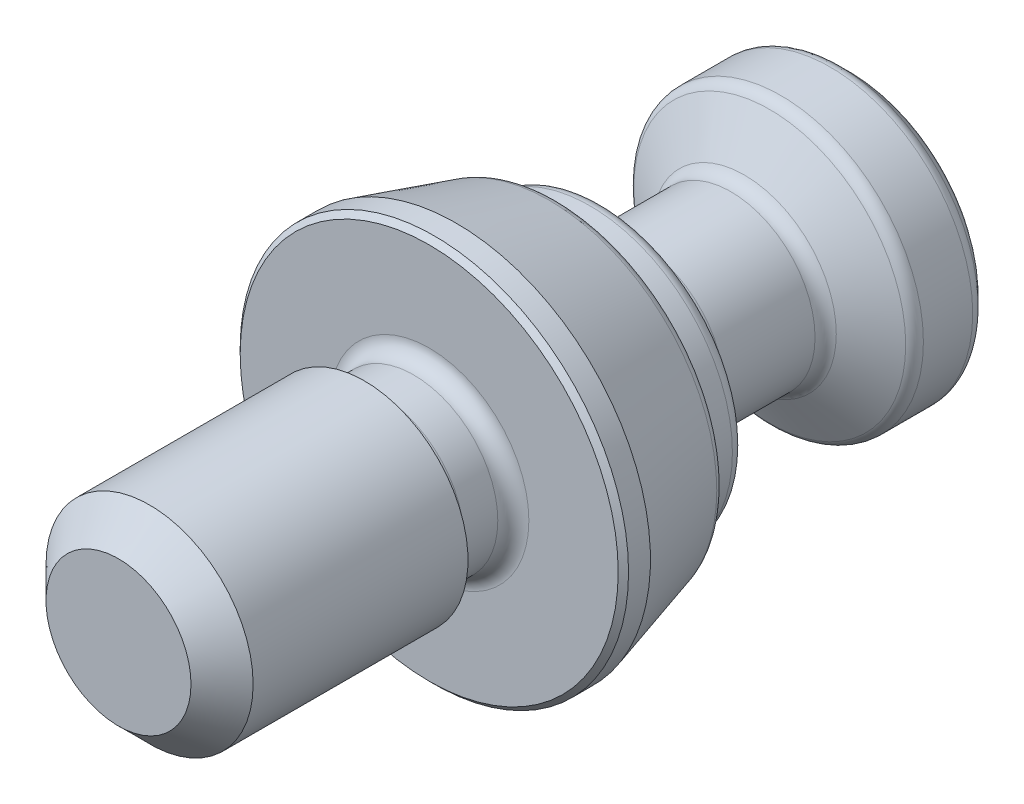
ISO-10303-21;
HEADER;
FILE_DESCRIPTION(('STEP AP214'),'2;1');
FILE_NAME('part.step','',(''),(''),'','','');
FILE_SCHEMA(('AUTOMOTIVE_DESIGN { 1 0 10303 214 1 1 1 1 }'));
ENDSEC;
DATA;
#1=APPLICATION_CONTEXT('core data for automotive mechanical design processes');
#2=APPLICATION_PROTOCOL_DEFINITION('international standard','automotive_design',2000,#1);
#3=PRODUCT_CONTEXT('',#1,'mechanical');
#4=PRODUCT('Part','Part','',(#3));
#5=PRODUCT_RELATED_PRODUCT_CATEGORY('part','',(#4));
#6=PRODUCT_DEFINITION_FORMATION('','',#4);
#7=PRODUCT_DEFINITION_CONTEXT('part definition',#1,'design');
#8=PRODUCT_DEFINITION('design','',#6,#7);
#9=PRODUCT_DEFINITION_SHAPE('','',#8);
#10=(LENGTH_UNIT() NAMED_UNIT(*) SI_UNIT(.MILLI.,.METRE.));
#11=(NAMED_UNIT(*) PLANE_ANGLE_UNIT() SI_UNIT($,.RADIAN.));
#12=(NAMED_UNIT(*) SI_UNIT($,.STERADIAN.) SOLID_ANGLE_UNIT());
#13=UNCERTAINTY_MEASURE_WITH_UNIT(LENGTH_MEASURE(1.E-05),#10,'distance_accuracy_value','');
#14=(GEOMETRIC_REPRESENTATION_CONTEXT(3) GLOBAL_UNCERTAINTY_ASSIGNED_CONTEXT((#13)) GLOBAL_UNIT_ASSIGNED_CONTEXT((#10,
#11,#12)) REPRESENTATION_CONTEXT('',''));
#15=CARTESIAN_POINT('',(0.,0.,0.));
#16=DIRECTION('',(0.,0.,1.));
#17=DIRECTION('',(1.,0.,0.));
#18=AXIS2_PLACEMENT_3D('',#15,#16,#17);
#19=CARTESIAN_POINT('',(0.,1.73205080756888,-14.));
#20=DIRECTION('',(0.,0.,-1.));
#21=DIRECTION('',(-1.,0.,0.));
#22=AXIS2_PLACEMENT_3D('',#19,#20,#21);
#23=PLANE('',#22);
#24=DIRECTION('',(0.,-1.,0.));
#25=VECTOR('',#24,1.);
#26=CARTESIAN_POINT('',(1.5,0.866025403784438,-14.));
#27=LINE('',#26,#25);
#28=CARTESIAN_POINT('',(1.5,0.866025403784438,-14.));
#29=VERTEX_POINT('',#28);
#30=CARTESIAN_POINT('',(1.5,0.,-14.));
#31=VERTEX_POINT('',#30);
#32=EDGE_CURVE('E222',#29,#31,#27,.T.);
#33=ORIENTED_EDGE('',*,*,#32,.T.);
#34=CARTESIAN_POINT('',(0.,0.,-14.));
#35=DIRECTION('',(0.,0.,1.));
#36=DIRECTION('',(1.,0.,0.));
#37=AXIS2_PLACEMENT_3D('',#34,#35,#36);
#38=CIRCLE('',#37,1.5);
#39=CARTESIAN_POINT('',(0.75,1.29903810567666,-14.));
#40=VERTEX_POINT('',#39);
#41=EDGE_CURVE('E29',#31,#40,#38,.T.);
#42=ORIENTED_EDGE('',*,*,#41,.T.);
#43=DIRECTION('',(0.866025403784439,-0.5,0.));
#44=VECTOR('',#43,1.);
#45=CARTESIAN_POINT('',(0.,1.73205080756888,-14.));
#46=LINE('',#45,#44);
#47=EDGE_CURVE('E685',#40,#29,#46,.T.);
#48=ORIENTED_EDGE('',*,*,#47,.T.);
#49=EDGE_LOOP('',(#33,#42,#48));
#50=FACE_BOUND('',#49,.T.);
#51=ADVANCED_FACE('F14',(#50),#23,.T.);
#52=CARTESIAN_POINT('',(0.,1.73205080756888,-14.));
#53=VERTEX_POINT('',#52);
#54=EDGE_CURVE('E686',#53,#40,#46,.T.);
#55=ORIENTED_EDGE('',*,*,#54,.T.);
#56=CARTESIAN_POINT('',(-0.75,1.29903810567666,-14.));
#57=VERTEX_POINT('',#56);
#58=EDGE_CURVE('E100',#40,#57,#38,.T.);
#59=ORIENTED_EDGE('',*,*,#58,.T.);
#60=DIRECTION('',(0.866025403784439,0.5,0.));
#61=VECTOR('',#60,1.);
#62=CARTESIAN_POINT('',(-1.5,0.86602540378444,-14.));
#63=LINE('',#62,#61);
#64=EDGE_CURVE('E681',#57,#53,#63,.T.);
#65=ORIENTED_EDGE('',*,*,#64,.T.);
#66=EDGE_LOOP('',(#55,#59,#65));
#67=FACE_BOUND('',#66,.T.);
#68=ADVANCED_FACE('F182',(#67),#23,.T.);
#69=CARTESIAN_POINT('',(-1.5,0.86602540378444,-14.));
#70=VERTEX_POINT('',#69);
#71=EDGE_CURVE('E682',#70,#57,#63,.T.);
#72=ORIENTED_EDGE('',*,*,#71,.T.);
#73=CARTESIAN_POINT('',(-1.5,0.,-14.));
#74=VERTEX_POINT('',#73);
#75=EDGE_CURVE('E704',#57,#74,#38,.T.);
#76=ORIENTED_EDGE('',*,*,#75,.T.);
#77=DIRECTION('',(0.,1.,0.));
#78=VECTOR('',#77,1.);
#79=CARTESIAN_POINT('',(-1.5,-0.866025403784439,-14.));
#80=LINE('',#79,#78);
#81=EDGE_CURVE('E227',#74,#70,#80,.T.);
#82=ORIENTED_EDGE('',*,*,#81,.T.);
#83=EDGE_LOOP('',(#72,#76,#82));
#84=FACE_BOUND('',#83,.T.);
#85=ADVANCED_FACE('F190',(#84),#23,.T.);
#86=CARTESIAN_POINT('',(-1.5,-0.866025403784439,-14.));
#87=VERTEX_POINT('',#86);
#88=EDGE_CURVE('E228',#87,#74,#80,.T.);
#89=ORIENTED_EDGE('',*,*,#88,.T.);
#90=CARTESIAN_POINT('',(-0.75,-1.29903810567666,-14.));
#91=VERTEX_POINT('',#90);
#92=EDGE_CURVE('E703',#74,#91,#38,.T.);
#93=ORIENTED_EDGE('',*,*,#92,.T.);
#94=DIRECTION('',(-0.866025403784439,0.5,0.));
#95=VECTOR('',#94,1.);
#96=CARTESIAN_POINT('',(0.,-1.73205080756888,-14.));
#97=LINE('',#96,#95);
#98=EDGE_CURVE('E217',#91,#87,#97,.T.);
#99=ORIENTED_EDGE('',*,*,#98,.T.);
#100=EDGE_LOOP('',(#89,#93,#99));
#101=FACE_BOUND('',#100,.T.);
#102=ADVANCED_FACE('F206',(#101),#23,.T.);
#103=CARTESIAN_POINT('',(0.,-1.73205080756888,-14.));
#104=VERTEX_POINT('',#103);
#105=EDGE_CURVE('E220',#104,#91,#97,.T.);
#106=ORIENTED_EDGE('',*,*,#105,.T.);
#107=CARTESIAN_POINT('',(0.75,-1.29903810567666,-14.));
#108=VERTEX_POINT('',#107);
#109=EDGE_CURVE('E701',#91,#108,#38,.T.);
#110=ORIENTED_EDGE('',*,*,#109,.T.);
#111=DIRECTION('',(-0.866025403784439,-0.5,0.));
#112=VECTOR('',#111,1.);
#113=CARTESIAN_POINT('',(1.5,-0.866025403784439,-14.));
#114=LINE('',#113,#112);
#115=EDGE_CURVE('E218',#108,#104,#114,.T.);
#116=ORIENTED_EDGE('',*,*,#115,.T.);
#117=EDGE_LOOP('',(#106,#110,#116));
#118=FACE_BOUND('',#117,.T.);
#119=ADVANCED_FACE('F196',(#118),#23,.T.);
#120=CARTESIAN_POINT('',(1.5,-0.866025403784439,-14.));
#121=VERTEX_POINT('',#120);
#122=EDGE_CURVE('E210',#121,#108,#114,.T.);
#123=ORIENTED_EDGE('',*,*,#122,.T.);
#124=EDGE_CURVE('E101',#108,#31,#38,.T.);
#125=ORIENTED_EDGE('',*,*,#124,.T.);
#126=EDGE_CURVE('E212',#31,#121,#27,.T.);
#127=ORIENTED_EDGE('',*,*,#126,.T.);
#128=EDGE_LOOP('',(#123,#125,#127));
#129=FACE_BOUND('',#128,.T.);
#130=ADVANCED_FACE('F185',(#129),#23,.T.);
#131=CARTESIAN_POINT('',(0.,5.5005,-16.5));
#132=DIRECTION('',(0.,0.,-1.));
#133=DIRECTION('',(-1.,0.,0.));
#134=AXIS2_PLACEMENT_3D('',#131,#132,#133);
#135=PLANE('',#134);
#136=CARTESIAN_POINT('',(0.,0.,-16.5));
#137=DIRECTION('',(0.,0.,-1.));
#138=DIRECTION('',(-1.,0.,0.));
#139=AXIS2_PLACEMENT_3D('',#136,#137,#138);
#140=CIRCLE('',#139,4.28578643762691);
#141=CARTESIAN_POINT('',(-4.28578643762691,0.,-16.5));
#142=VERTEX_POINT('',#141);
#143=EDGE_CURVE('E269',#142,#142,#140,.T.);
#144=ORIENTED_EDGE('',*,*,#143,.T.);
#145=EDGE_LOOP('',(#144));
#146=FACE_BOUND('',#145,.T.);
#147=CARTESIAN_POINT('',(0.,0.,-16.5));
#148=DIRECTION('',(0.,0.,1.));
#149=DIRECTION('',(1.,0.,0.));
#150=AXIS2_PLACEMENT_3D('',#147,#148,#149);
#151=CIRCLE('',#150,2.);
#152=CARTESIAN_POINT('',(2.,0.,-16.5));
#153=VERTEX_POINT('',#152);
#154=EDGE_CURVE('E98',#153,#153,#151,.T.);
#155=ORIENTED_EDGE('',*,*,#154,.T.);
#156=EDGE_LOOP('',(#155));
#157=FACE_BOUND('',#156,.T.);
#158=ADVANCED_FACE('F195',(#146,#157),#135,.T.);
#159=CARTESIAN_POINT('',(0.,0.,0.));
#160=DIRECTION('',(0.,0.,1.));
#161=DIRECTION('',(1.,0.,0.));
#162=AXIS2_PLACEMENT_3D('',#159,#160,#161);
#163=CYLINDRICAL_SURFACE('',#162,5.5);
#164=CARTESIAN_POINT('',(0.,0.,-15.4928932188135));
#165=DIRECTION('',(0.,0.,-1.));
#166=DIRECTION('',(-1.,0.,0.));
#167=AXIS2_PLACEMENT_3D('',#164,#165,#166);
#168=CIRCLE('',#167,5.5);
#169=CARTESIAN_POINT('',(-5.5,0.,-15.4928932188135));
#170=VERTEX_POINT('',#169);
#171=EDGE_CURVE('E293',#170,#170,#168,.F.);
#172=ORIENTED_EDGE('',*,*,#171,.T.);
#173=EDGE_LOOP('',(#172));
#174=FACE_BOUND('',#173,.T.);
#175=CARTESIAN_POINT('',(0.,0.,-13.5877132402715));
#176=DIRECTION('',(0.,0.,-1.));
#177=DIRECTION('',(-1.,0.,0.));
#178=AXIS2_PLACEMENT_3D('',#175,#176,#177);
#179=CIRCLE('',#178,5.5);
#180=CARTESIAN_POINT('',(-5.5,0.,-13.5877132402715));
#181=VERTEX_POINT('',#180);
#182=EDGE_CURVE('E290',#181,#181,#179,.T.);
#183=ORIENTED_EDGE('',*,*,#182,.T.);
#184=EDGE_LOOP('',(#183));
#185=FACE_BOUND('',#184,.T.);
#186=ADVANCED_FACE('F203',(#174,#185),#163,.T.);
#187=CARTESIAN_POINT('',(0.,0.,0.));
#188=DIRECTION('',(0.,0.,-1.));
#189=DIRECTION('',(-1.,0.,0.));
#190=AXIS2_PLACEMENT_3D('',#187,#188,#189);
#191=CYLINDRICAL_SURFACE('',#190,5.5005);
#192=CARTESIAN_POINT('',(0.,0.,-5.4));
#193=DIRECTION('',(0.,0.,-1.));
#194=DIRECTION('',(-1.,0.,0.));
#195=AXIS2_PLACEMENT_3D('',#192,#193,#194);
#196=CIRCLE('',#195,5.5005);
#197=CARTESIAN_POINT('',(-5.5005,0.,-5.4));
#198=VERTEX_POINT('',#197);
#199=EDGE_CURVE('E9',#198,#198,#196,.T.);
#200=ORIENTED_EDGE('',*,*,#199,.T.);
#201=EDGE_LOOP('',(#200));
#202=FACE_BOUND('',#201,.T.);
#203=CARTESIAN_POINT('',(0.,0.,-6.21132486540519));
#204=DIRECTION('',(0.,0.,-1.));
#205=DIRECTION('',(-1.,0.,0.));
#206=AXIS2_PLACEMENT_3D('',#203,#204,#205);
#207=CIRCLE('',#206,5.5005);
#208=CARTESIAN_POINT('',(-5.5005,0.,-6.21132486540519));
#209=VERTEX_POINT('',#208);
#210=EDGE_CURVE('E302',#209,#209,#207,.F.);
#211=ORIENTED_EDGE('',*,*,#210,.T.);
#212=EDGE_LOOP('',(#211));
#213=FACE_BOUND('',#212,.T.);
#214=ADVANCED_FACE('F330',(#202,#213),#191,.T.);
#215=CARTESIAN_POINT('',(0.,0.,-6.5));
#216=DIRECTION('',(0.,0.,1.));
#217=DIRECTION('',(1.,0.,0.));
#218=AXIS2_PLACEMENT_3D('',#215,#216,#217);
#219=CONICAL_SURFACE('',#218,5.5005,1.0471975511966);
#220=CARTESIAN_POINT('',(0.,0.,-6.64433756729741));
#221=DIRECTION('',(0.,0.,-1.));
#222=DIRECTION('',(-1.,0.,0.));
#223=AXIS2_PLACEMENT_3D('',#220,#221,#222);
#224=CIRCLE('',#223,5.2505);
#225=CARTESIAN_POINT('',(-5.2505,0.,-6.64433756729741));
#226=VERTEX_POINT('',#225);
#227=EDGE_CURVE('E305',#226,#226,#224,.T.);
#228=ORIENTED_EDGE('',*,*,#227,.T.);
#229=EDGE_LOOP('',(#228));
#230=FACE_BOUND('',#229,.T.);
#231=CARTESIAN_POINT('',(0.,0.,-7.62612170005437));
#232=DIRECTION('',(0.,0.,1.));
#233=DIRECTION('',(1.,0.,0.));
#234=AXIS2_PLACEMENT_3D('',#231,#232,#233);
#235=CIRCLE('',#234,3.55);
#236=CARTESIAN_POINT('',(3.55,0.,-7.62612170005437));
#237=VERTEX_POINT('',#236);
#238=EDGE_CURVE('E257',#237,#237,#235,.T.);
#239=ORIENTED_EDGE('',*,*,#238,.T.);
#240=EDGE_LOOP('',(#239));
#241=FACE_BOUND('',#240,.T.);
#242=ADVANCED_FACE('F333',(#230,#241),#219,.T.);
#243=CARTESIAN_POINT('',(0.,0.,0.));
#244=DIRECTION('',(0.,0.,1.));
#245=DIRECTION('',(1.,0.,0.));
#246=AXIS2_PLACEMENT_3D('',#243,#244,#245);
#247=CYLINDRICAL_SURFACE('',#246,3.25);
#248=CARTESIAN_POINT('',(0.,0.,-11.6535898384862));
#249=DIRECTION('',(0.,0.,1.));
#250=DIRECTION('',(1.,0.,0.));
#251=AXIS2_PLACEMENT_3D('',#248,#249,#250);
#252=CIRCLE('',#251,3.25);
#253=CARTESIAN_POINT('',(3.25,0.,-11.6535898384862));
#254=VERTEX_POINT('',#253);
#255=EDGE_CURVE('E251',#254,#254,#252,.T.);
#256=ORIENTED_EDGE('',*,*,#255,.T.);
#257=EDGE_LOOP('',(#256));
#258=FACE_BOUND('',#257,.T.);
#259=CARTESIAN_POINT('',(0.,0.,-8.14573694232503));
#260=DIRECTION('',(0.,0.,1.));
#261=DIRECTION('',(1.,0.,0.));
#262=AXIS2_PLACEMENT_3D('',#259,#260,#261);
#263=CIRCLE('',#262,3.25);
#264=CARTESIAN_POINT('',(3.25,0.,-8.14573694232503));
#265=VERTEX_POINT('',#264);
#266=EDGE_CURVE('E235',#265,#265,#263,.F.);
#267=ORIENTED_EDGE('',*,*,#266,.T.);
#268=EDGE_LOOP('',(#267));
#269=FACE_BOUND('',#268,.T.);
#270=ADVANCED_FACE('F397',(#258,#269),#247,.T.);
#271=CARTESIAN_POINT('',(0.,0.,-12.));
#272=DIRECTION('',(0.,0.,-1.));
#273=DIRECTION('',(-1.,0.,0.));
#274=AXIS2_PLACEMENT_3D('',#271,#272,#273);
#275=CONICAL_SURFACE('',#274,3.25,1.0471975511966);
#276=CARTESIAN_POINT('',(0.,0.,-13.1547005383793));
#277=DIRECTION('',(0.,0.,1.));
#278=DIRECTION('',(1.,0.,0.));
#279=AXIS2_PLACEMENT_3D('',#276,#277,#278);
#280=CIRCLE('',#279,5.25);
#281=CARTESIAN_POINT('',(5.25,0.,-13.1547005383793));
#282=VERTEX_POINT('',#281);
#283=EDGE_CURVE('E299',#282,#282,#280,.T.);
#284=ORIENTED_EDGE('',*,*,#283,.T.);
#285=EDGE_LOOP('',(#284));
#286=FACE_BOUND('',#285,.T.);
#287=CARTESIAN_POINT('',(0.,0.,-12.1732050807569));
#288=DIRECTION('',(0.,0.,-1.));
#289=DIRECTION('',(-1.,0.,0.));
#290=AXIS2_PLACEMENT_3D('',#287,#288,#289);
#291=CIRCLE('',#290,3.55);
#292=CARTESIAN_POINT('',(-3.55,0.,-12.1732050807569));
#293=VERTEX_POINT('',#292);
#294=EDGE_CURVE('E254',#293,#293,#291,.T.);
#295=ORIENTED_EDGE('',*,*,#294,.T.);
#296=EDGE_LOOP('',(#295));
#297=FACE_BOUND('',#296,.T.);
#298=ADVANCED_FACE('F401',(#286,#297),#275,.T.);
#299=CARTESIAN_POINT('',(0.,0.,-15.7));
#300=DIRECTION('',(0.,0.,1.));
#301=DIRECTION('',(1.,0.,0.));
#302=AXIS2_PLACEMENT_3D('',#299,#300,#301);
#303=CONICAL_SURFACE('',#302,5.5,0.785398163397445);
#304=CARTESIAN_POINT('',(0.,0.,-15.8464466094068));
#305=DIRECTION('',(0.,0.,-1.));
#306=DIRECTION('',(-1.,0.,0.));
#307=AXIS2_PLACEMENT_3D('',#304,#305,#306);
#308=CIRCLE('',#307,5.35355339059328);
#309=CARTESIAN_POINT('',(-5.35355339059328,0.,-15.8464466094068));
#310=VERTEX_POINT('',#309);
#311=EDGE_CURVE('E296',#310,#310,#308,.T.);
#312=ORIENTED_EDGE('',*,*,#311,.T.);
#313=EDGE_LOOP('',(#312));
#314=FACE_BOUND('',#313,.T.);
#315=CARTESIAN_POINT('',(0.,0.,-16.2071067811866));
#316=DIRECTION('',(0.,0.,-1.));
#317=DIRECTION('',(-1.,0.,0.));
#318=AXIS2_PLACEMENT_3D('',#315,#316,#317);
#319=CIRCLE('',#318,4.99289321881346);
#320=CARTESIAN_POINT('',(-4.99289321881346,0.,-16.2071067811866));
#321=VERTEX_POINT('',#320);
#322=EDGE_CURVE('E266',#321,#321,#319,.F.);
#323=ORIENTED_EDGE('',*,*,#322,.T.);
#324=EDGE_LOOP('',(#323));
#325=FACE_BOUND('',#324,.T.);
#326=ADVANCED_FACE('F383',(#314,#325),#303,.T.);
#327=CARTESIAN_POINT('',(0.,0.,-11.6535898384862));
#328=DIRECTION('',(0.,0.,1.));
#329=DIRECTION('',(1.,0.,0.));
#330=AXIS2_PLACEMENT_3D('',#327,#328,#329);
#331=TOROIDAL_SURFACE('',#330,3.85,0.6);
#332=ORIENTED_EDGE('',*,*,#294,.F.);
#333=EDGE_LOOP('',(#332));
#334=FACE_BOUND('',#333,.T.);
#335=ORIENTED_EDGE('',*,*,#255,.F.);
#336=EDGE_LOOP('',(#335));
#337=FACE_BOUND('',#336,.T.);
#338=ADVANCED_FACE('F379',(#334,#337),#331,.F.);
#339=CARTESIAN_POINT('',(0.,0.,-8.14573694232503));
#340=DIRECTION('',(0.,0.,1.));
#341=DIRECTION('',(1.,0.,0.));
#342=AXIS2_PLACEMENT_3D('',#339,#340,#341);
#343=TOROIDAL_SURFACE('',#342,3.85,0.6);
#344=ORIENTED_EDGE('',*,*,#266,.F.);
#345=EDGE_LOOP('',(#344));
#346=FACE_BOUND('',#345,.T.);
#347=ORIENTED_EDGE('',*,*,#238,.F.);
#348=EDGE_LOOP('',(#347));
#349=FACE_BOUND('',#348,.T.);
#350=ADVANCED_FACE('F369',(#346,#349),#343,.F.);
#351=CARTESIAN_POINT('',(0.,0.,-15.5));
#352=DIRECTION('',(0.,0.,-1.));
#353=DIRECTION('',(-1.,0.,0.));
#354=AXIS2_PLACEMENT_3D('',#351,#352,#353);
#355=TOROIDAL_SURFACE('',#354,4.28578643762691,1.);
#356=ORIENTED_EDGE('',*,*,#143,.F.);
#357=EDGE_LOOP('',(#356));
#358=FACE_BOUND('',#357,.T.);
#359=ORIENTED_EDGE('',*,*,#322,.F.);
#360=EDGE_LOOP('',(#359));
#361=FACE_BOUND('',#360,.T.);
#362=ADVANCED_FACE('F131',(#358,#361),#355,.T.);
#363=CARTESIAN_POINT('',(0.,0.,-16.5));
#364=DIRECTION('',(0.,0.,-1.));
#365=DIRECTION('',(-1.,0.,0.));
#366=AXIS2_PLACEMENT_3D('',#363,#364,#365);
#367=CONICAL_SURFACE('',#366,2.,1.0471975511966);
#368=ORIENTED_EDGE('',*,*,#154,.F.);
#369=EDGE_LOOP('',(#368));
#370=FACE_BOUND('',#369,.T.);
#371=CARTESIAN_POINT('',(1.5002,0.8659099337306,-16.3453661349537));
#372=CARTESIAN_POINT('',(1.43428070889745,0.903968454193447,-16.3233823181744));
#373=CARTESIAN_POINT('',(1.36779241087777,0.942355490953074,-16.303388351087));
#374=CARTESIAN_POINT('',(1.23366433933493,1.01979436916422,-16.2684875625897));
#375=CARTESIAN_POINT('',(1.16602218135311,1.05884758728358,-16.2535930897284));
#376=CARTESIAN_POINT('',(1.03157622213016,1.13646999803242,-16.2304061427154));
#377=CARTESIAN_POINT('',(0.964793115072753,1.17502724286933,-16.221959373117));
#378=CARTESIAN_POINT('',(0.830912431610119,1.25232329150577,-16.211873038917));
#379=CARTESIAN_POINT('',(0.763815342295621,1.29106181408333,-16.2102251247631));
#380=CARTESIAN_POINT('',(0.638425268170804,1.363455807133,-16.2136410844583));
#381=CARTESIAN_POINT('',(0.580113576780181,1.39712207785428,-16.2178662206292));
#382=CARTESIAN_POINT('',(0.463870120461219,1.46423526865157,-16.2312612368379));
#383=CARTESIAN_POINT('',(0.405938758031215,1.49768195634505,-16.240435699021));
#384=CARTESIAN_POINT('',(0.289455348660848,1.56493368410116,-16.2633726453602));
#385=CARTESIAN_POINT('',(0.230918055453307,1.59873020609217,-16.2772324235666));
#386=CARTESIAN_POINT('',(0.114716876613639,1.6658189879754,-16.3086892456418));
#387=CARTESIAN_POINT('',(0.0570515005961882,1.699112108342,-16.3262788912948));
#388=CARTESIAN_POINT('',(-0.000200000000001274,1.73216627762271,-16.3453661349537));
#389=B_SPLINE_CURVE_WITH_KNOTS('',3,(#371,#372,#373,#374,#375,#376,#377,#378,#379,#380,#381,
#382,#383,#384,#385,#386,#387,#388),.UNSPECIFIED.,.F.,.F.,(4,2,2,2,2,2,2,2,4),(0.,
0.237777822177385,0.476127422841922,0.708577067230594,0.940741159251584,1.14294352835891,
1.34533342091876,1.55221450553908,1.75868901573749),.UNSPECIFIED.);
#390=CARTESIAN_POINT('',(1.5,0.866025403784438,-16.3452994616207));
#391=VERTEX_POINT('',#390);
#392=CARTESIAN_POINT('',(0.,1.73205080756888,-16.3452994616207));
#393=VERTEX_POINT('',#392);
#394=EDGE_CURVE('E37',#391,#393,#389,.T.);
#395=ORIENTED_EDGE('',*,*,#394,.T.);
#396=CARTESIAN_POINT('',(0.000199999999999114,1.73216627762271,-16.3453661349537));
#397=CARTESIAN_POINT('',(-0.0657192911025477,1.69410775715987,-16.3233823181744));
#398=CARTESIAN_POINT('',(-0.132207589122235,1.65572072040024,-16.303388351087));
#399=CARTESIAN_POINT('',(-0.266335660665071,1.5782818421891,-16.2684875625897));
#400=CARTESIAN_POINT('',(-0.333977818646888,1.53922862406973,-16.2535930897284));
#401=CARTESIAN_POINT('',(-0.468423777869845,1.4616062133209,-16.2304061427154));
#402=CARTESIAN_POINT('',(-0.53520688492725,1.42304896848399,-16.221959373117));
#403=CARTESIAN_POINT('',(-0.669087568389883,1.34575291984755,-16.211873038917));
#404=CARTESIAN_POINT('',(-0.736184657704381,1.30701439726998,-16.2102251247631));
#405=CARTESIAN_POINT('',(-0.861574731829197,1.23462040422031,-16.2136410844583));
#406=CARTESIAN_POINT('',(-0.91988642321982,1.20095413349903,-16.2178662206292));
#407=CARTESIAN_POINT('',(-1.03612987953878,1.13384094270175,-16.2312612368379));
#408=CARTESIAN_POINT('',(-1.09406124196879,1.10039425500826,-16.240435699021));
#409=CARTESIAN_POINT('',(-1.21054465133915,1.03314252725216,-16.2633726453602));
#410=CARTESIAN_POINT('',(-1.26908194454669,0.999346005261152,-16.2772324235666));
#411=CARTESIAN_POINT('',(-1.38528312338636,0.932257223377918,-16.3086892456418));
#412=CARTESIAN_POINT('',(-1.44294849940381,0.898964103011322,-16.3262788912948));
#413=CARTESIAN_POINT('',(-1.5002,0.865909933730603,-16.3453661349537));
#414=B_SPLINE_CURVE_WITH_KNOTS('',3,(#396,#397,#398,#399,#400,#401,#402,#403,#404,#405,#406,
#407,#408,#409,#410,#411,#412,#413),.UNSPECIFIED.,.F.,.F.,(4,2,2,2,2,2,2,2,4),(0.,
0.237777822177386,0.476127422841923,0.708577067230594,0.940741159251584,1.14294352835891,
1.34533342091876,1.55221450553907,1.75868901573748),.UNSPECIFIED.);
#415=CARTESIAN_POINT('',(-1.5,0.86602540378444,-16.3452994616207));
#416=VERTEX_POINT('',#415);
#417=EDGE_CURVE('E107',#393,#416,#414,.T.);
#418=ORIENTED_EDGE('',*,*,#417,.T.);
#419=CARTESIAN_POINT('',(-1.5,-2.28397410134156,-16.9229071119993));
#420=CARTESIAN_POINT('',(-1.5,-2.21878991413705,-16.8914593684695));
#421=CARTESIAN_POINT('',(-1.5,-2.1534515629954,-16.8603257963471));
#422=CARTESIAN_POINT('',(-1.5,-2.02238403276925,-16.7988644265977));
#423=CARTESIAN_POINT('',(-1.5,-1.95665478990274,-16.7685367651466));
#424=CARTESIAN_POINT('',(-1.5,-1.82436364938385,-16.7087029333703));
#425=CARTESIAN_POINT('',(-1.5,-1.75779913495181,-16.6792025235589));
#426=CARTESIAN_POINT('',(-1.5,-1.62412650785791,-16.6214679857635));
#427=CARTESIAN_POINT('',(-1.5,-1.55701842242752,-16.5932337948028));
#428=CARTESIAN_POINT('',(-1.5,-1.42017535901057,-16.537561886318));
#429=CARTESIAN_POINT('',(-1.5,-1.35042088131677,-16.5101714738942));
#430=CARTESIAN_POINT('',(-1.5,-1.21009481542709,-16.4575777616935));
#431=CARTESIAN_POINT('',(-1.5,-1.13952312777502,-16.4323747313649));
#432=CARTESIAN_POINT('',(-1.5,-0.926675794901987,-16.3610629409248));
#433=CARTESIAN_POINT('',(-1.5,-0.782896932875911,-16.3190937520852));
#434=CARTESIAN_POINT('',(-1.5,-0.564495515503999,-16.2698234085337));
#435=CARTESIAN_POINT('',(-1.5,-0.491421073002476,-16.2556984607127));
#436=CARTESIAN_POINT('',(-1.5,-0.344405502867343,-16.2329184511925));
#437=CARTESIAN_POINT('',(-1.5,-0.27046444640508,-16.2242629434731));
#438=CARTESIAN_POINT('',(-1.5,-0.123035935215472,-16.2132228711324));
#439=CARTESIAN_POINT('',(-1.5,-0.0495544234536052,-16.2107610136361));
#440=CARTESIAN_POINT('',(-1.5,0.0973486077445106,-16.212108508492));
#441=CARTESIAN_POINT('',(-1.5,0.170770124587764,-16.2159181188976));
#442=CARTESIAN_POINT('',(-1.5,0.349490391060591,-16.2324885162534));
#443=CARTESIAN_POINT('',(-1.5,0.454491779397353,-16.2484687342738));
#444=CARTESIAN_POINT('',(-1.5,0.662502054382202,-16.2903432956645));
#445=CARTESIAN_POINT('',(-1.5,0.765508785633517,-16.3162477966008));
#446=CARTESIAN_POINT('',(-1.5,0.971670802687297,-16.3758329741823));
#447=CARTESIAN_POINT('',(-1.5,1.07477868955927,-16.409673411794));
#448=CARTESIAN_POINT('',(-1.5,1.279089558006,-16.4824928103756));
#449=CARTESIAN_POINT('',(-1.5,1.38029312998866,-16.521470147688));
#450=CARTESIAN_POINT('',(-1.5,1.62283010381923,-16.6198322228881));
#451=CARTESIAN_POINT('',(-1.5,1.76343848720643,-16.6809869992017));
#452=CARTESIAN_POINT('',(-1.5,2.0427026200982,-16.8076296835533));
#453=CARTESIAN_POINT('',(-1.5,2.18135782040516,-16.8731187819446));
#454=CARTESIAN_POINT('',(-1.5,2.4574437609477,-17.0069670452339));
#455=CARTESIAN_POINT('',(-1.5,2.59487311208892,-17.0753290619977));
#456=CARTESIAN_POINT('',(-1.5,2.86877401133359,-17.2139473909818));
#457=CARTESIAN_POINT('',(-1.5,3.0052455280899,-17.2842037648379));
#458=CARTESIAN_POINT('',(-1.5,3.26576619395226,-17.4199372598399));
#459=CARTESIAN_POINT('',(-1.5,3.38987264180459,-17.4853046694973));
#460=CARTESIAN_POINT('',(-1.5,3.63764859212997,-17.6168720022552));
#461=CARTESIAN_POINT('',(-1.5,3.76131807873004,-17.6830719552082));
#462=CARTESIAN_POINT('',(-1.5,4.00801757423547,-17.8159423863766));
#463=CARTESIAN_POINT('',(-1.5,4.13104840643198,-17.8826113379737));
#464=CARTESIAN_POINT('',(-1.5,4.37683251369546,-18.0164434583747));
#465=CARTESIAN_POINT('',(-1.5,4.49958580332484,-18.0836066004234));
#466=CARTESIAN_POINT('',(-1.5,4.62223761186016,-18.1509533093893));
#467=B_SPLINE_CURVE_WITH_KNOTS('',3,(#419,#420,#421,#422,#423,#424,#425,#426,#427,#428,#429,
#430,#431,#432,#433,#434,#435,#436,#437,#438,#439,#440,#441,#442,#443,#444,#445,#446,#447,#448,
#449,#450,#451,#452,#453,#454,#455,#456,#457,#458,#459,#460,#461,#462,#463,#464,#465,#466),
.UNSPECIFIED.,.F.,.F.,(4,2,2,2,2,2,2,2,2,2,2,2,2,2,2,2,2,2,2,2,2,2,2,4),(0.,0.217123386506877,
0.434283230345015,0.65269809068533,0.871102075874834,1.09588117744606,1.3206879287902,
1.7690939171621,1.99221104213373,2.21530997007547,2.43561063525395,2.65592036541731,
2.9738941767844,3.29219430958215,3.61755574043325,3.94281457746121,4.40267752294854,
4.86266729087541,5.3231249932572,5.78359769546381,6.20439980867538,6.62521705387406,
7.04501578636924,7.46479195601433),.UNSPECIFIED.);
#468=CARTESIAN_POINT('',(-1.5,-0.866025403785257,-16.3452994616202));
#469=VERTEX_POINT('',#468);
#470=EDGE_CURVE('E115',#416,#469,#467,.F.);
#471=ORIENTED_EDGE('',*,*,#470,.T.);
#472=CARTESIAN_POINT('',(-1.5002,-0.865909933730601,-16.3453661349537));
#473=CARTESIAN_POINT('',(-1.43428070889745,-0.903968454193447,-16.3233823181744));
#474=CARTESIAN_POINT('',(-1.36779241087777,-0.942355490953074,-16.303388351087));
#475=CARTESIAN_POINT('',(-1.23366433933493,-1.01979436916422,-16.2684875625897));
#476=CARTESIAN_POINT('',(-1.16602218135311,-1.05884758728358,-16.2535930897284));
#477=CARTESIAN_POINT('',(-1.03157622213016,-1.13646999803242,-16.2304061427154));
#478=CARTESIAN_POINT('',(-0.964793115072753,-1.17502724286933,-16.221959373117));
#479=CARTESIAN_POINT('',(-0.83091243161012,-1.25232329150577,-16.211873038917));
#480=CARTESIAN_POINT('',(-0.763815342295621,-1.29106181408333,-16.2102251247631));
#481=CARTESIAN_POINT('',(-0.638425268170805,-1.363455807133,-16.2136410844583));
#482=CARTESIAN_POINT('',(-0.580113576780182,-1.39712207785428,-16.2178662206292));
#483=CARTESIAN_POINT('',(-0.46387012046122,-1.46423526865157,-16.2312612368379));
#484=CARTESIAN_POINT('',(-0.405938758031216,-1.49768195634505,-16.240435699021));
#485=CARTESIAN_POINT('',(-0.289455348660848,-1.56493368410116,-16.2633726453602));
#486=CARTESIAN_POINT('',(-0.230918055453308,-1.59873020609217,-16.2772324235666));
#487=CARTESIAN_POINT('',(-0.114716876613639,-1.6658189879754,-16.3086892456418));
#488=CARTESIAN_POINT('',(-0.0570515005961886,-1.699112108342,-16.3262788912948));
#489=CARTESIAN_POINT('',(0.000200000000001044,-1.73216627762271,-16.3453661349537));
#490=B_SPLINE_CURVE_WITH_KNOTS('',3,(#472,#473,#474,#475,#476,#477,#478,#479,#480,#481,#482,
#483,#484,#485,#486,#487,#488,#489),.UNSPECIFIED.,.F.,.F.,(4,2,2,2,2,2,2,2,4),(0.,
0.237777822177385,0.476127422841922,0.708577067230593,0.940741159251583,1.14294352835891,
1.34533342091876,1.55221450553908,1.75868901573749),.UNSPECIFIED.);
#491=CARTESIAN_POINT('',(0.,-1.73205080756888,-16.3452994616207));
#492=VERTEX_POINT('',#491);
#493=EDGE_CURVE('E141',#469,#492,#490,.T.);
#494=ORIENTED_EDGE('',*,*,#493,.T.);
#495=CARTESIAN_POINT('',(-0.000199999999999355,-1.73216627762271,-16.3453661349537));
#496=CARTESIAN_POINT('',(0.0657192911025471,-1.69410775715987,-16.3233823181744));
#497=CARTESIAN_POINT('',(0.132207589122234,-1.65572072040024,-16.303388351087));
#498=CARTESIAN_POINT('',(0.26633566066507,-1.5782818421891,-16.2684875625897));
#499=CARTESIAN_POINT('',(0.333977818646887,-1.53922862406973,-16.2535930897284));
#500=CARTESIAN_POINT('',(0.468423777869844,-1.4616062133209,-16.2304061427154));
#501=CARTESIAN_POINT('',(0.535206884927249,-1.42304896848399,-16.221959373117));
#502=CARTESIAN_POINT('',(0.669087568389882,-1.34575291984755,-16.211873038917));
#503=CARTESIAN_POINT('',(0.73618465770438,-1.30701439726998,-16.2102251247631));
#504=CARTESIAN_POINT('',(0.861574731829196,-1.23462040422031,-16.2136410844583));
#505=CARTESIAN_POINT('',(0.91988642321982,-1.20095413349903,-16.2178662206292));
#506=CARTESIAN_POINT('',(1.03612987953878,-1.13384094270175,-16.2312612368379));
#507=CARTESIAN_POINT('',(1.09406124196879,-1.10039425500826,-16.240435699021));
#508=CARTESIAN_POINT('',(1.21054465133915,-1.03314252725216,-16.2633726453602));
#509=CARTESIAN_POINT('',(1.26908194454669,-0.999346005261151,-16.2772324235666));
#510=CARTESIAN_POINT('',(1.38528312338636,-0.932257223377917,-16.3086892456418));
#511=CARTESIAN_POINT('',(1.44294849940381,-0.89896410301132,-16.3262788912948));
#512=CARTESIAN_POINT('',(1.5002,-0.865909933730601,-16.3453661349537));
#513=B_SPLINE_CURVE_WITH_KNOTS('',3,(#495,#496,#497,#498,#499,#500,#501,#502,#503,#504,#505,
#506,#507,#508,#509,#510,#511,#512),.UNSPECIFIED.,.F.,.F.,(4,2,2,2,2,2,2,2,4),(0.,
0.237777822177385,0.476127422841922,0.708577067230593,0.940741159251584,1.14294352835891,
1.34533342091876,1.55221450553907,1.75868901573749),.UNSPECIFIED.);
#514=CARTESIAN_POINT('',(1.5,-0.866025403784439,-16.3452994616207));
#515=VERTEX_POINT('',#514);
#516=EDGE_CURVE('E148',#492,#515,#513,.T.);
#517=ORIENTED_EDGE('',*,*,#516,.T.);
#518=CARTESIAN_POINT('',(1.5,-2.28397410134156,-16.9229071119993));
#519=CARTESIAN_POINT('',(1.5,-2.21878991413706,-16.8914593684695));
#520=CARTESIAN_POINT('',(1.5,-2.1534515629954,-16.8603257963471));
#521=CARTESIAN_POINT('',(1.5,-2.02238403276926,-16.7988644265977));
#522=CARTESIAN_POINT('',(1.5,-1.95665478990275,-16.7685367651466));
#523=CARTESIAN_POINT('',(1.5,-1.82436364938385,-16.7087029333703));
#524=CARTESIAN_POINT('',(1.5,-1.75779913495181,-16.6792025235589));
#525=CARTESIAN_POINT('',(1.5,-1.62412650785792,-16.6214679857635));
#526=CARTESIAN_POINT('',(1.5,-1.55701842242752,-16.5932337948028));
#527=CARTESIAN_POINT('',(1.5,-1.42017535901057,-16.537561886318));
#528=CARTESIAN_POINT('',(1.5,-1.35042088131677,-16.5101714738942));
#529=CARTESIAN_POINT('',(1.5,-1.21009481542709,-16.4575777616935));
#530=CARTESIAN_POINT('',(1.5,-1.13952312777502,-16.4323747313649));
#531=CARTESIAN_POINT('',(1.5,-0.926675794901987,-16.3610629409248));
#532=CARTESIAN_POINT('',(1.5,-0.782896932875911,-16.3190937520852));
#533=CARTESIAN_POINT('',(1.5,-0.564495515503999,-16.2698234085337));
#534=CARTESIAN_POINT('',(1.5,-0.491421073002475,-16.2556984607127));
#535=CARTESIAN_POINT('',(1.5,-0.344405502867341,-16.2329184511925));
#536=CARTESIAN_POINT('',(1.5,-0.270464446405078,-16.2242629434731));
#537=CARTESIAN_POINT('',(1.5,-0.123035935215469,-16.2132228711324));
#538=CARTESIAN_POINT('',(1.5,-0.0495544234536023,-16.2107610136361));
#539=CARTESIAN_POINT('',(1.5,0.097348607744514,-16.212108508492));
#540=CARTESIAN_POINT('',(1.5,0.170770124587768,-16.2159181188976));
#541=CARTESIAN_POINT('',(1.5,0.349490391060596,-16.2324885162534));
#542=CARTESIAN_POINT('',(1.5,0.454491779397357,-16.2484687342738));
#543=CARTESIAN_POINT('',(1.5,0.662502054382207,-16.2903432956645));
#544=CARTESIAN_POINT('',(1.5,0.765508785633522,-16.3162477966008));
#545=CARTESIAN_POINT('',(1.5,0.971670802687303,-16.3758329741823));
#546=CARTESIAN_POINT('',(1.5,1.07477868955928,-16.409673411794));
#547=CARTESIAN_POINT('',(1.5,1.27908955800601,-16.4824928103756));
#548=CARTESIAN_POINT('',(1.5,1.38029312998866,-16.521470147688));
#549=CARTESIAN_POINT('',(1.5,1.62283010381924,-16.6198322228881));
#550=CARTESIAN_POINT('',(1.5,1.76343848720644,-16.6809869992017));
#551=CARTESIAN_POINT('',(1.5,2.04270262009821,-16.8076296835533));
#552=CARTESIAN_POINT('',(1.5,2.18135782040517,-16.8731187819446));
#553=CARTESIAN_POINT('',(1.5,2.45744376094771,-17.0069670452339));
#554=CARTESIAN_POINT('',(1.5,2.59487311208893,-17.0753290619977));
#555=CARTESIAN_POINT('',(1.5,2.8687740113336,-17.2139473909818));
#556=CARTESIAN_POINT('',(1.5,3.00524552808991,-17.2842037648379));
#557=CARTESIAN_POINT('',(1.5,3.26576619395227,-17.4199372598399));
#558=CARTESIAN_POINT('',(1.5,3.3898726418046,-17.4853046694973));
#559=CARTESIAN_POINT('',(1.5,3.63764859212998,-17.6168720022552));
#560=CARTESIAN_POINT('',(1.5,3.76131807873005,-17.6830719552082));
#561=CARTESIAN_POINT('',(1.5,4.00801757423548,-17.8159423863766));
#562=CARTESIAN_POINT('',(1.5,4.13104840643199,-17.8826113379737));
#563=CARTESIAN_POINT('',(1.5,4.37683251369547,-18.0164434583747));
#564=CARTESIAN_POINT('',(1.5,4.49958580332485,-18.0836066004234));
#565=CARTESIAN_POINT('',(1.5,4.62223761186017,-18.1509533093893));
#566=B_SPLINE_CURVE_WITH_KNOTS('',3,(#518,#519,#520,#521,#522,#523,#524,#525,#526,#527,#528,
#529,#530,#531,#532,#533,#534,#535,#536,#537,#538,#539,#540,#541,#542,#543,#544,#545,#546,#547,
#548,#549,#550,#551,#552,#553,#554,#555,#556,#557,#558,#559,#560,#561,#562,#563,#564,#565),
.UNSPECIFIED.,.F.,.F.,(4,2,2,2,2,2,2,2,2,2,2,2,2,2,2,2,2,2,2,2,2,2,2,4),(0.,0.217123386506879,
0.434283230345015,0.652698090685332,0.871102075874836,1.09588117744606,1.3206879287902,
1.76909391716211,1.99221104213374,2.21530997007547,2.43561063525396,2.65592036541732,
2.9738941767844,3.29219430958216,3.61755574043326,3.94281457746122,4.40267752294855,
4.86266729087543,5.32312499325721,5.78359769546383,6.2043998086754,6.62521705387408,
7.04501578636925,7.46479195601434),.UNSPECIFIED.);
#567=EDGE_CURVE('E155',#515,#391,#566,.T.);
#568=ORIENTED_EDGE('',*,*,#567,.T.);
#569=EDGE_LOOP('',(#395,#418,#471,#494,#517,#568));
#570=FACE_BOUND('',#569,.T.);
#571=ADVANCED_FACE('F126',(#370,#570),#367,.F.);
#572=CARTESIAN_POINT('',(-1.5,0.86602540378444,-14.));
#573=DIRECTION('',(-0.5,0.866025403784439,0.));
#574=DIRECTION('',(-0.866025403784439,-0.5,0.));
#575=AXIS2_PLACEMENT_3D('',#572,#573,#574);
#576=PLANE('',#575);
#577=ORIENTED_EDGE('',*,*,#417,.F.);
#578=DIRECTION('',(0.,0.,-1.));
#579=VECTOR('',#578,1.);
#580=CARTESIAN_POINT('',(0.,1.73205080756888,-14.));
#581=LINE('',#580,#579);
#582=EDGE_CURVE('E231',#53,#393,#581,.T.);
#583=ORIENTED_EDGE('',*,*,#582,.F.);
#584=ORIENTED_EDGE('',*,*,#64,.F.);
#585=ORIENTED_EDGE('',*,*,#71,.F.);
#586=DIRECTION('',(0.,0.,-1.));
#587=VECTOR('',#586,1.);
#588=CARTESIAN_POINT('',(-1.5,0.86602540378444,-14.));
#589=LINE('',#588,#587);
#590=EDGE_CURVE('E232',#70,#416,#589,.T.);
#591=ORIENTED_EDGE('',*,*,#590,.T.);
#592=EDGE_LOOP('',(#577,#583,#584,#585,#591));
#593=FACE_BOUND('',#592,.T.);
#594=ADVANCED_FACE('F122',(#593),#576,.F.);
#595=CARTESIAN_POINT('',(-1.5,-0.866025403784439,-14.));
#596=DIRECTION('',(-1.,0.,0.));
#597=DIRECTION('',(0.,-1.,0.));
#598=AXIS2_PLACEMENT_3D('',#595,#596,#597);
#599=PLANE('',#598);
#600=ORIENTED_EDGE('',*,*,#470,.F.);
#601=ORIENTED_EDGE('',*,*,#590,.F.);
#602=ORIENTED_EDGE('',*,*,#81,.F.);
#603=ORIENTED_EDGE('',*,*,#88,.F.);
#604=DIRECTION('',(0.,0.,-1.));
#605=VECTOR('',#604,1.);
#606=CARTESIAN_POINT('',(-1.5,-0.866025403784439,-14.));
#607=LINE('',#606,#605);
#608=EDGE_CURVE('E236',#87,#469,#607,.T.);
#609=ORIENTED_EDGE('',*,*,#608,.T.);
#610=EDGE_LOOP('',(#600,#601,#602,#603,#609));
#611=FACE_BOUND('',#610,.T.);
#612=ADVANCED_FACE('F492',(#611),#599,.F.);
#613=CARTESIAN_POINT('',(0.,-1.73205080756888,-14.));
#614=DIRECTION('',(-0.5,-0.866025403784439,0.));
#615=DIRECTION('',(0.866025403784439,-0.5,0.));
#616=AXIS2_PLACEMENT_3D('',#613,#614,#615);
#617=PLANE('',#616);
#618=ORIENTED_EDGE('',*,*,#493,.F.);
#619=ORIENTED_EDGE('',*,*,#608,.F.);
#620=ORIENTED_EDGE('',*,*,#98,.F.);
#621=ORIENTED_EDGE('',*,*,#105,.F.);
#622=DIRECTION('',(0.,0.,-1.));
#623=VECTOR('',#622,1.);
#624=CARTESIAN_POINT('',(0.,-1.73205080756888,-14.));
#625=LINE('',#624,#623);
#626=EDGE_CURVE('E239',#104,#492,#625,.T.);
#627=ORIENTED_EDGE('',*,*,#626,.T.);
#628=EDGE_LOOP('',(#618,#619,#620,#621,#627));
#629=FACE_BOUND('',#628,.T.);
#630=ADVANCED_FACE('F500',(#629),#617,.F.);
#631=CARTESIAN_POINT('',(1.5,-0.866025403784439,-14.));
#632=DIRECTION('',(0.5,-0.866025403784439,0.));
#633=DIRECTION('',(0.866025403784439,0.5,0.));
#634=AXIS2_PLACEMENT_3D('',#631,#632,#633);
#635=PLANE('',#634);
#636=ORIENTED_EDGE('',*,*,#516,.F.);
#637=ORIENTED_EDGE('',*,*,#626,.F.);
#638=ORIENTED_EDGE('',*,*,#115,.F.);
#639=ORIENTED_EDGE('',*,*,#122,.F.);
#640=DIRECTION('',(0.,0.,-1.));
#641=VECTOR('',#640,1.);
#642=CARTESIAN_POINT('',(1.5,-0.866025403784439,-14.));
#643=LINE('',#642,#641);
#644=EDGE_CURVE('E242',#121,#515,#643,.T.);
#645=ORIENTED_EDGE('',*,*,#644,.T.);
#646=EDGE_LOOP('',(#636,#637,#638,#639,#645));
#647=FACE_BOUND('',#646,.T.);
#648=ADVANCED_FACE('F170',(#647),#635,.F.);
#649=CARTESIAN_POINT('',(1.5,0.866025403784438,-14.));
#650=DIRECTION('',(1.,0.,0.));
#651=DIRECTION('',(0.,1.,0.));
#652=AXIS2_PLACEMENT_3D('',#649,#650,#651);
#653=PLANE('',#652);
#654=ORIENTED_EDGE('',*,*,#567,.F.);
#655=ORIENTED_EDGE('',*,*,#644,.F.);
#656=ORIENTED_EDGE('',*,*,#126,.F.);
#657=ORIENTED_EDGE('',*,*,#32,.F.);
#658=DIRECTION('',(0.,0.,-1.));
#659=VECTOR('',#658,1.);
#660=CARTESIAN_POINT('',(1.5,0.866025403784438,-14.));
#661=LINE('',#660,#659);
#662=EDGE_CURVE('E244',#29,#391,#661,.T.);
#663=ORIENTED_EDGE('',*,*,#662,.T.);
#664=EDGE_LOOP('',(#654,#655,#656,#657,#663));
#665=FACE_BOUND('',#664,.T.);
#666=ADVANCED_FACE('F166',(#665),#653,.F.);
#667=CARTESIAN_POINT('',(0.,1.73205080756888,-14.));
#668=DIRECTION('',(0.5,0.866025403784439,0.));
#669=DIRECTION('',(-0.866025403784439,0.5,0.));
#670=AXIS2_PLACEMENT_3D('',#667,#668,#669);
#671=PLANE('',#670);
#672=ORIENTED_EDGE('',*,*,#394,.F.);
#673=ORIENTED_EDGE('',*,*,#662,.F.);
#674=ORIENTED_EDGE('',*,*,#47,.F.);
#675=ORIENTED_EDGE('',*,*,#54,.F.);
#676=ORIENTED_EDGE('',*,*,#582,.T.);
#677=EDGE_LOOP('',(#672,#673,#674,#675,#676));
#678=FACE_BOUND('',#677,.T.);
#679=ADVANCED_FACE('F169',(#678),#671,.F.);
#680=CARTESIAN_POINT('',(0.,0.,0.));
#681=DIRECTION('',(0.,0.,1.));
#682=DIRECTION('',(1.,0.,0.));
#683=AXIS2_PLACEMENT_3D('',#680,#681,#682);
#684=CYLINDRICAL_SURFACE('',#683,1.5);
#685=CARTESIAN_POINT('',(0.,0.,-12.5));
#686=DIRECTION('',(0.,0.,1.));
#687=DIRECTION('',(1.,0.,0.));
#688=AXIS2_PLACEMENT_3D('',#685,#686,#687);
#689=CIRCLE('',#688,1.5);
#690=CARTESIAN_POINT('',(1.5,0.,-12.5));
#691=VERTEX_POINT('',#690);
#692=EDGE_CURVE('E94',#691,#691,#689,.T.);
#693=ORIENTED_EDGE('',*,*,#692,.T.);
#694=EDGE_LOOP('',(#693));
#695=FACE_BOUND('',#694,.T.);
#696=ORIENTED_EDGE('',*,*,#41,.F.);
#697=ORIENTED_EDGE('',*,*,#124,.F.);
#698=ORIENTED_EDGE('',*,*,#109,.F.);
#699=ORIENTED_EDGE('',*,*,#92,.F.);
#700=ORIENTED_EDGE('',*,*,#75,.F.);
#701=ORIENTED_EDGE('',*,*,#58,.F.);
#702=EDGE_LOOP('',(#696,#697,#698,#699,#700,#701));
#703=FACE_BOUND('',#702,.T.);
#704=ADVANCED_FACE('F90',(#695,#703),#684,.F.);
#705=CARTESIAN_POINT('',(0.,0.,-12.5));
#706=DIRECTION('',(0.,0.,-1.));
#707=DIRECTION('',(-1.,0.,0.));
#708=AXIS2_PLACEMENT_3D('',#705,#706,#707);
#709=CONICAL_SURFACE('',#708,1.5,1.17809724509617);
#710=CARTESIAN_POINT('',(0.,0.,-11.8786796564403));
#711=VERTEX_POINT('',#710);
#712=VERTEX_LOOP('',#711);
#713=FACE_BOUND('',#712,.T.);
#714=ORIENTED_EDGE('',*,*,#692,.F.);
#715=EDGE_LOOP('',(#714));
#716=FACE_BOUND('',#715,.T.);
#717=ADVANCED_FACE('F86',(#713,#716),#709,.F.);
#718=CARTESIAN_POINT('',(0.,0.,0.));
#719=DIRECTION('',(0.,0.,-1.));
#720=DIRECTION('',(-1.,0.,0.));
#721=AXIS2_PLACEMENT_3D('',#718,#719,#720);
#722=CYLINDRICAL_SURFACE('',#721,7.5);
#723=CARTESIAN_POINT('',(0.,0.,-0.199999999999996));
#724=DIRECTION('',(0.,0.,1.));
#725=DIRECTION('',(1.,0.,0.));
#726=AXIS2_PLACEMENT_3D('',#723,#724,#725);
#727=CIRCLE('',#726,7.5);
#728=CARTESIAN_POINT('',(7.5,0.,-0.199999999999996));
#729=VERTEX_POINT('',#728);
#730=EDGE_CURVE('E284',#729,#729,#727,.F.);
#731=ORIENTED_EDGE('',*,*,#730,.T.);
#732=EDGE_LOOP('',(#731));
#733=FACE_BOUND('',#732,.T.);
#734=CARTESIAN_POINT('',(0.,0.,-1.04622433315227));
#735=DIRECTION('',(0.,0.,-1.));
#736=DIRECTION('',(-1.,0.,0.));
#737=AXIS2_PLACEMENT_3D('',#734,#735,#736);
#738=CIRCLE('',#737,7.5);
#739=CARTESIAN_POINT('',(-7.5,0.,-1.04622433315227));
#740=VERTEX_POINT('',#739);
#741=EDGE_CURVE('E96',#740,#740,#738,.T.);
#742=ORIENTED_EDGE('',*,*,#741,.F.);
#743=EDGE_LOOP('',(#742));
#744=FACE_BOUND('',#743,.T.);
#745=ADVANCED_FACE('F89',(#733,#744),#722,.T.);
#746=CARTESIAN_POINT('',(0.,5.5005,-5.));
#747=DIRECTION('',(0.,0.,-1.));
#748=DIRECTION('',(-1.,0.,0.));
#749=AXIS2_PLACEMENT_3D('',#746,#747,#748);
#750=PLANE('',#749);
#751=CARTESIAN_POINT('',(0.,0.,-5.));
#752=DIRECTION('',(0.,0.,-1.));
#753=DIRECTION('',(-1.,0.,0.));
#754=AXIS2_PLACEMENT_3D('',#751,#752,#753);
#755=CIRCLE('',#754,5.9005);
#756=CARTESIAN_POINT('',(-5.9005,0.,-5.));
#757=VERTEX_POINT('',#756);
#758=EDGE_CURVE('E22',#757,#757,#755,.F.);
#759=ORIENTED_EDGE('',*,*,#758,.T.);
#760=EDGE_LOOP('',(#759));
#761=FACE_BOUND('',#760,.T.);
#762=CARTESIAN_POINT('',(0.,0.,-5.));
#763=DIRECTION('',(0.,0.,-1.));
#764=DIRECTION('',(-1.,0.,0.));
#765=AXIS2_PLACEMENT_3D('',#762,#763,#764);
#766=CIRCLE('',#765,5.98949604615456);
#767=CARTESIAN_POINT('',(-5.98949604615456,0.,-5.));
#768=VERTEX_POINT('',#767);
#769=EDGE_CURVE('E308',#768,#768,#766,.T.);
#770=ORIENTED_EDGE('',*,*,#769,.T.);
#771=EDGE_LOOP('',(#770));
#772=FACE_BOUND('',#771,.T.);
#773=ADVANCED_FACE('F316',(#761,#772),#750,.T.);
#774=CARTESIAN_POINT('',(0.,0.,-5.));
#775=DIRECTION('',(0.,0.,1.));
#776=DIRECTION('',(1.,0.,0.));
#777=AXIS2_PLACEMENT_3D('',#774,#775,#776);
#778=CONICAL_SURFACE('',#777,6.36627307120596,0.279252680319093);
#779=CARTESIAN_POINT('',(0.,0.,-4.6378186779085));
#780=DIRECTION('',(0.,0.,-1.));
#781=DIRECTION('',(-1.,0.,0.));
#782=AXIS2_PLACEMENT_3D('',#779,#780,#781);
#783=CIRCLE('',#782,6.47012689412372);
#784=CARTESIAN_POINT('',(-6.47012689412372,0.,-4.6378186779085));
#785=VERTEX_POINT('',#784);
#786=EDGE_CURVE('E311',#785,#785,#783,.F.);
#787=ORIENTED_EDGE('',*,*,#786,.T.);
#788=EDGE_LOOP('',(#787));
#789=FACE_BOUND('',#788,.T.);
#790=ORIENTED_EDGE('',*,*,#741,.T.);
#791=EDGE_LOOP('',(#790));
#792=FACE_BOUND('',#791,.T.);
#793=ADVANCED_FACE('F393',(#789,#792),#778,.T.);
#794=CARTESIAN_POINT('',(0.,0.,12.));
#795=DIRECTION('',(0.,0.,1.));
#796=DIRECTION('',(1.,0.,0.));
#797=AXIS2_PLACEMENT_3D('',#794,#795,#796);
#798=PLANE('',#797);
#799=CARTESIAN_POINT('',(0.,0.,12.));
#800=DIRECTION('',(0.,0.,1.));
#801=DIRECTION('',(1.,0.,0.));
#802=AXIS2_PLACEMENT_3D('',#799,#800,#801);
#803=CIRCLE('',#802,2.8);
#804=CARTESIAN_POINT('',(2.8,0.,12.));
#805=VERTEX_POINT('',#804);
#806=EDGE_CURVE('E263',#805,#805,#803,.T.);
#807=ORIENTED_EDGE('',*,*,#806,.T.);
#808=EDGE_LOOP('',(#807));
#809=FACE_BOUND('',#808,.T.);
#810=ADVANCED_FACE('F375',(#809),#798,.T.);
#811=CARTESIAN_POINT('',(0.,0.,10.8));
#812=DIRECTION('',(0.,0.,-1.));
#813=DIRECTION('',(-1.,0.,0.));
#814=AXIS2_PLACEMENT_3D('',#811,#812,#813);
#815=CONICAL_SURFACE('',#814,4.,0.785398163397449);
#816=ORIENTED_EDGE('',*,*,#806,.F.);
#817=EDGE_LOOP('',(#816));
#818=FACE_BOUND('',#817,.T.);
#819=CARTESIAN_POINT('',(0.,0.,10.8));
#820=DIRECTION('',(0.,0.,1.));
#821=DIRECTION('',(1.,0.,0.));
#822=AXIS2_PLACEMENT_3D('',#819,#820,#821);
#823=CIRCLE('',#822,4.);
#824=CARTESIAN_POINT('',(4.,0.,10.8));
#825=VERTEX_POINT('',#824);
#826=EDGE_CURVE('E260',#825,#825,#823,.F.);
#827=ORIENTED_EDGE('',*,*,#826,.F.);
#828=EDGE_LOOP('',(#827));
#829=FACE_BOUND('',#828,.T.);
#830=ADVANCED_FACE('F371',(#818,#829),#815,.T.);
#831=CARTESIAN_POINT('',(0.,0.,0.));
#832=DIRECTION('',(0.,0.,-1.));
#833=DIRECTION('',(-1.,0.,0.));
#834=AXIS2_PLACEMENT_3D('',#831,#832,#833);
#835=CYLINDRICAL_SURFACE('',#834,4.);
#836=CARTESIAN_POINT('',(0.,0.,2.5));
#837=DIRECTION('',(0.,0.,-1.));
#838=DIRECTION('',(-1.,0.,0.));
#839=AXIS2_PLACEMENT_3D('',#836,#837,#838);
#840=CIRCLE('',#839,4.);
#841=CARTESIAN_POINT('',(-4.,0.,2.5));
#842=VERTEX_POINT('',#841);
#843=EDGE_CURVE('E680',#842,#842,#840,.T.);
#844=ORIENTED_EDGE('',*,*,#843,.F.);
#845=EDGE_LOOP('',(#844));
#846=FACE_BOUND('',#845,.T.);
#847=ORIENTED_EDGE('',*,*,#826,.T.);
#848=EDGE_LOOP('',(#847));
#849=FACE_BOUND('',#848,.T.);
#850=ADVANCED_FACE('F374',(#846,#849),#835,.T.);
#851=CARTESIAN_POINT('',(0.,4.,2.5));
#852=DIRECTION('',(0.,0.,1.));
#853=DIRECTION('',(1.,0.,0.));
#854=AXIS2_PLACEMENT_3D('',#851,#852,#853);
#855=PLANE('',#854);
#856=CARTESIAN_POINT('',(0.,0.,2.5));
#857=DIRECTION('',(0.,0.,1.));
#858=DIRECTION('',(1.,0.,0.));
#859=AXIS2_PLACEMENT_3D('',#856,#857,#858);
#860=CIRCLE('',#859,3.85);
#861=CARTESIAN_POINT('',(3.85,0.,2.5));
#862=VERTEX_POINT('',#861);
#863=EDGE_CURVE('E278',#862,#862,#860,.T.);
#864=ORIENTED_EDGE('',*,*,#863,.T.);
#865=EDGE_LOOP('',(#864));
#866=FACE_BOUND('',#865,.T.);
#867=ORIENTED_EDGE('',*,*,#843,.T.);
#868=EDGE_LOOP('',(#867));
#869=FACE_BOUND('',#868,.T.);
#870=ADVANCED_FACE('F365',(#866,#869),#855,.F.);
#871=CARTESIAN_POINT('',(0.,0.,1.9));
#872=DIRECTION('',(0.,0.,1.));
#873=DIRECTION('',(1.,0.,0.));
#874=AXIS2_PLACEMENT_3D('',#871,#872,#873);
#875=TOROIDAL_SURFACE('',#874,3.85,0.6);
#876=ORIENTED_EDGE('',*,*,#863,.F.);
#877=EDGE_LOOP('',(#876));
#878=FACE_BOUND('',#877,.T.);
#879=CARTESIAN_POINT('',(0.,0.,1.9));
#880=DIRECTION('',(0.,0.,1.));
#881=DIRECTION('',(1.,0.,0.));
#882=AXIS2_PLACEMENT_3D('',#879,#880,#881);
#883=CIRCLE('',#882,3.25);
#884=CARTESIAN_POINT('',(3.25,0.,1.9));
#885=VERTEX_POINT('',#884);
#886=EDGE_CURVE('E275',#885,#885,#883,.F.);
#887=ORIENTED_EDGE('',*,*,#886,.F.);
#888=EDGE_LOOP('',(#887));
#889=FACE_BOUND('',#888,.T.);
#890=ADVANCED_FACE('F362',(#878,#889),#875,.F.);
#891=CARTESIAN_POINT('',(0.,0.,0.));
#892=DIRECTION('',(0.,0.,-1.));
#893=DIRECTION('',(-1.,0.,0.));
#894=AXIS2_PLACEMENT_3D('',#891,#892,#893);
#895=CYLINDRICAL_SURFACE('',#894,3.25);
#896=ORIENTED_EDGE('',*,*,#886,.T.);
#897=EDGE_LOOP('',(#896));
#898=FACE_BOUND('',#897,.T.);
#899=CARTESIAN_POINT('',(0.,0.,0.6));
#900=DIRECTION('',(0.,0.,1.));
#901=DIRECTION('',(1.,0.,0.));
#902=AXIS2_PLACEMENT_3D('',#899,#900,#901);
#903=CIRCLE('',#902,3.25);
#904=CARTESIAN_POINT('',(3.25,0.,0.6));
#905=VERTEX_POINT('',#904);
#906=EDGE_CURVE('E272',#905,#905,#903,.T.);
#907=ORIENTED_EDGE('',*,*,#906,.T.);
#908=EDGE_LOOP('',(#907));
#909=FACE_BOUND('',#908,.T.);
#910=ADVANCED_FACE('F133',(#898,#909),#895,.T.);
#911=CARTESIAN_POINT('',(0.,0.,0.6));
#912=DIRECTION('',(0.,0.,1.));
#913=DIRECTION('',(1.,0.,0.));
#914=AXIS2_PLACEMENT_3D('',#911,#912,#913);
#915=TOROIDAL_SURFACE('',#914,3.85,0.6);
#916=ORIENTED_EDGE('',*,*,#906,.F.);
#917=EDGE_LOOP('',(#916));
#918=FACE_BOUND('',#917,.T.);
#919=CARTESIAN_POINT('',(0.,0.,0.));
#920=DIRECTION('',(0.,0.,1.));
#921=DIRECTION('',(1.,0.,0.));
#922=AXIS2_PLACEMENT_3D('',#919,#920,#921);
#923=CIRCLE('',#922,3.85);
#924=CARTESIAN_POINT('',(3.85,0.,0.));
#925=VERTEX_POINT('',#924);
#926=EDGE_CURVE('E281',#925,#925,#923,.F.);
#927=ORIENTED_EDGE('',*,*,#926,.F.);
#928=EDGE_LOOP('',(#927));
#929=FACE_BOUND('',#928,.T.);
#930=ADVANCED_FACE('F358',(#918,#929),#915,.F.);
#931=CARTESIAN_POINT('',(0.,4.,0.));
#932=DIRECTION('',(0.,0.,1.));
#933=DIRECTION('',(1.,0.,0.));
#934=AXIS2_PLACEMENT_3D('',#931,#932,#933);
#935=PLANE('',#934);
#936=CARTESIAN_POINT('',(0.,0.,0.));
#937=DIRECTION('',(0.,0.,1.));
#938=DIRECTION('',(1.,0.,0.));
#939=AXIS2_PLACEMENT_3D('',#936,#937,#938);
#940=CIRCLE('',#939,7.3);
#941=CARTESIAN_POINT('',(7.3,0.,0.));
#942=VERTEX_POINT('',#941);
#943=EDGE_CURVE('E287',#942,#942,#940,.T.);
#944=ORIENTED_EDGE('',*,*,#943,.T.);
#945=EDGE_LOOP('',(#944));
#946=FACE_BOUND('',#945,.T.);
#947=ORIENTED_EDGE('',*,*,#926,.T.);
#948=EDGE_LOOP('',(#947));
#949=FACE_BOUND('',#948,.T.);
#950=ADVANCED_FACE('F356',(#946,#949),#935,.T.);
#951=CARTESIAN_POINT('',(0.,0.,-0.199999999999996));
#952=DIRECTION('',(0.,0.,-1.));
#953=DIRECTION('',(-1.,0.,0.));
#954=AXIS2_PLACEMENT_3D('',#951,#952,#953);
#955=CONICAL_SURFACE('',#954,7.5,0.785398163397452);
#956=ORIENTED_EDGE('',*,*,#943,.F.);
#957=EDGE_LOOP('',(#956));
#958=FACE_BOUND('',#957,.T.);
#959=ORIENTED_EDGE('',*,*,#730,.F.);
#960=EDGE_LOOP('',(#959));
#961=FACE_BOUND('',#960,.T.);
#962=ADVANCED_FACE('F352',(#958,#961),#955,.T.);
#963=CARTESIAN_POINT('',(0.,0.,-15.4928932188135));
#964=DIRECTION('',(0.,0.,-1.));
#965=DIRECTION('',(-1.,0.,0.));
#966=AXIS2_PLACEMENT_3D('',#963,#964,#965);
#967=TOROIDAL_SURFACE('',#966,5.,0.5);
#968=ORIENTED_EDGE('',*,*,#311,.F.);
#969=EDGE_LOOP('',(#968));
#970=FACE_BOUND('',#969,.T.);
#971=ORIENTED_EDGE('',*,*,#171,.F.);
#972=EDGE_LOOP('',(#971));
#973=FACE_BOUND('',#972,.T.);
#974=ADVANCED_FACE('F345',(#970,#973),#967,.T.);
#975=CARTESIAN_POINT('',(0.,0.,-13.5877132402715));
#976=DIRECTION('',(0.,0.,-1.));
#977=DIRECTION('',(-1.,0.,0.));
#978=AXIS2_PLACEMENT_3D('',#975,#976,#977);
#979=TOROIDAL_SURFACE('',#978,5.,0.5);
#980=ORIENTED_EDGE('',*,*,#182,.F.);
#981=EDGE_LOOP('',(#980));
#982=FACE_BOUND('',#981,.T.);
#983=ORIENTED_EDGE('',*,*,#283,.F.);
#984=EDGE_LOOP('',(#983));
#985=FACE_BOUND('',#984,.T.);
#986=ADVANCED_FACE('F338',(#982,#985),#979,.T.);
#987=CARTESIAN_POINT('',(0.,0.,-6.21132486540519));
#988=DIRECTION('',(0.,0.,-1.));
#989=DIRECTION('',(-1.,0.,0.));
#990=AXIS2_PLACEMENT_3D('',#987,#988,#989);
#991=TOROIDAL_SURFACE('',#990,5.0005,0.5);
#992=ORIENTED_EDGE('',*,*,#227,.F.);
#993=EDGE_LOOP('',(#992));
#994=FACE_BOUND('',#993,.T.);
#995=ORIENTED_EDGE('',*,*,#210,.F.);
#996=EDGE_LOOP('',(#995));
#997=FACE_BOUND('',#996,.T.);
#998=ADVANCED_FACE('F326',(#994,#997),#991,.T.);
#999=CARTESIAN_POINT('',(0.,0.,-4.5));
#1000=DIRECTION('',(0.,0.,-1.));
#1001=DIRECTION('',(-1.,0.,0.));
#1002=AXIS2_PLACEMENT_3D('',#999,#1000,#1001);
#1003=TOROIDAL_SURFACE('',#1002,5.98949604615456,0.5);
#1004=ORIENTED_EDGE('',*,*,#786,.F.);
#1005=EDGE_LOOP('',(#1004));
#1006=FACE_BOUND('',#1005,.T.);
#1007=ORIENTED_EDGE('',*,*,#769,.F.);
#1008=EDGE_LOOP('',(#1007));
#1009=FACE_BOUND('',#1008,.T.);
#1010=ADVANCED_FACE('F320',(#1006,#1009),#1003,.T.);
#1011=CARTESIAN_POINT('',(0.,0.,-5.4));
#1012=DIRECTION('',(0.,0.,-1.));
#1013=DIRECTION('',(-1.,0.,0.));
#1014=AXIS2_PLACEMENT_3D('',#1011,#1012,#1013);
#1015=TOROIDAL_SURFACE('',#1014,5.9005,0.4);
#1016=ORIENTED_EDGE('',*,*,#199,.F.);
#1017=EDGE_LOOP('',(#1016));
#1018=FACE_BOUND('',#1017,.T.);
#1019=ORIENTED_EDGE('',*,*,#758,.F.);
#1020=EDGE_LOOP('',(#1019));
#1021=FACE_BOUND('',#1020,.T.);
#1022=ADVANCED_FACE('F16',(#1018,#1021),#1015,.F.);
#1023=CLOSED_SHELL('',(#51,#68,#85,#102,#119,#130,#158,#186,#214,#242,#270,#298,#326,#338,#350,
#362,#571,#594,#612,#630,#648,#666,#679,#704,#717,#745,#773,#793,#810,#830,#850,#870,#890,#910,
#930,#950,#962,#974,#986,#998,#1010,#1022));
#1024=MANIFOLD_SOLID_BREP('B1',#1023);
#1025=ADVANCED_BREP_SHAPE_REPRESENTATION('',(#18,#1024),#14);
#1026=SHAPE_DEFINITION_REPRESENTATION(#9,#1025);
ENDSEC;
END-ISO-10303-21;
